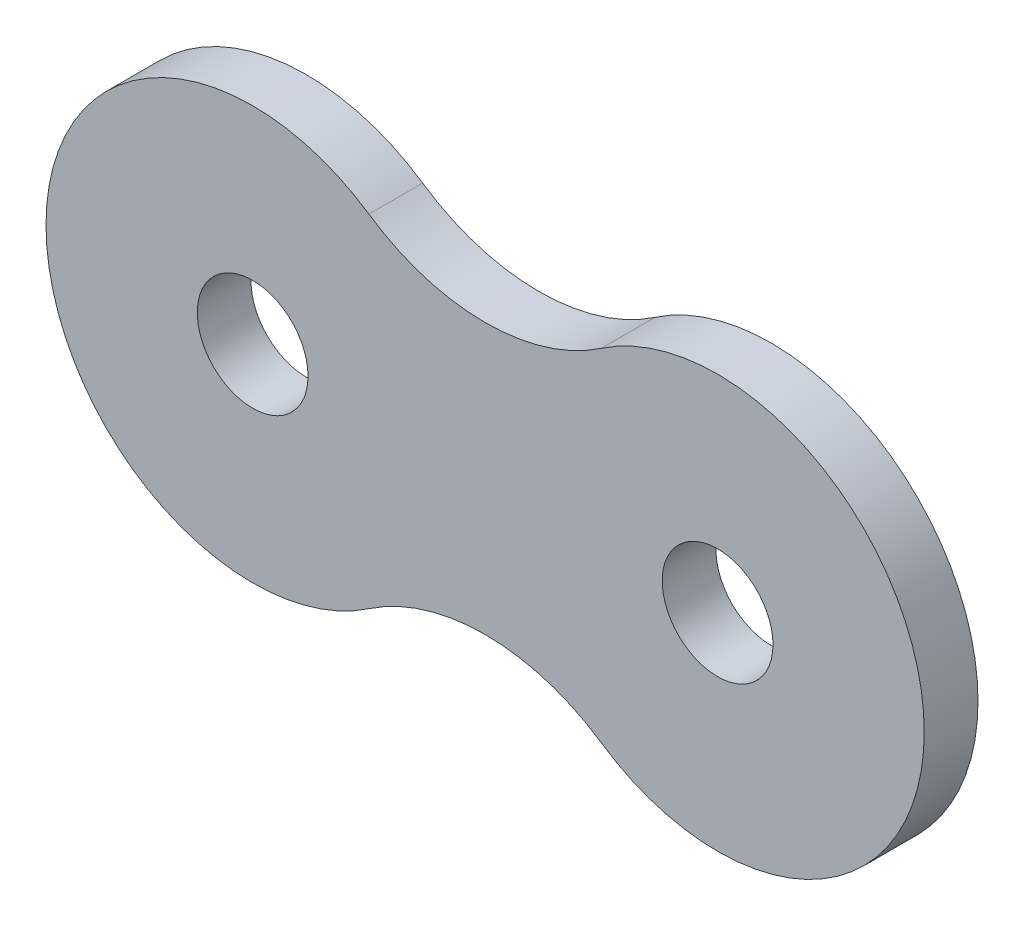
from build123d import *

# Parameters (mm, degrees)
ESQUISSE1_R        = 2.269
BOSS_EXTRU_1_DEPTH = 2.202


with BuildPart() as part:
    # Esquisse1 → Boss.-Extru.1 (new body)
    with BuildSketch(Plane.XY):
        with BuildLine():
            ThreePointArc((-44.833579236, 7.000620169), (-58.063079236, 0), (-44.833579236, -7.000620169))
            ThreePointArc((-44.833579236, -7.000620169), (-40.071079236, -5.534240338), (-35.308579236, -7.000620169))
            ThreePointArc((-35.308579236, -7.000620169), (-22.079079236, 0), (-35.308579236, 7.000620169))
            ThreePointArc((-35.308579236, 7.000620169), (-40.071079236, 5.534240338), (-44.833579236, 7.000620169))
        make_face()
        with Locations((-49.596079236, 0)):
            Circle(ESQUISSE1_R, mode=Mode.SUBTRACT)
        with Locations((-30.546079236, 0)):
            Circle(ESQUISSE1_R, mode=Mode.SUBTRACT)
    extrude(amount=BOSS_EXTRU_1_DEPTH)


solid = part.part
